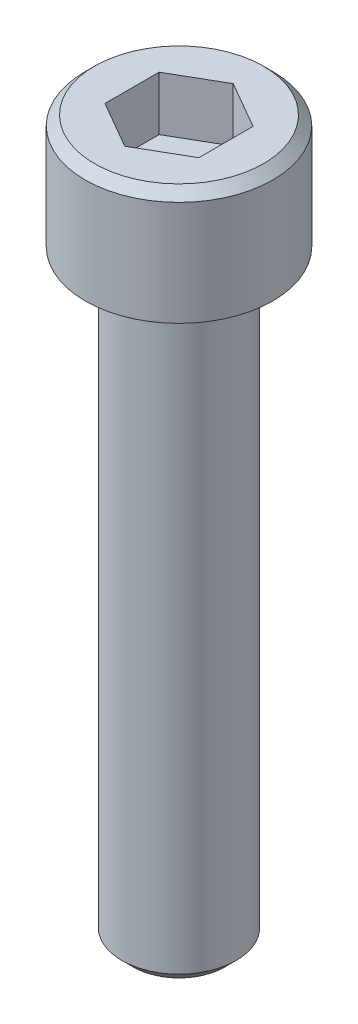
from build123d import *

# Parameters (mm, degrees)
CUT_EXTRUDE1_DEPTH = 2.286


with BuildPart() as part:
    # Sketch1 → Base-Revolve (revolve)
    with BuildSketch(Plane.XY, mode=Mode.PRIVATE) as base_revolve_sk:
        Polygon((0, 0), (3.96875, 0), (3.96875, 4.429125), (3.571875, 4.826), (0, 4.826), align=None)
    revolve(base_revolve_sk.sketch.rotate(Axis((0, 0, 0), (0, 1, 0)), 90), axis=Axis((0, 0, 0), (0, 1, 0)))

    # Sketch2 → Boss-Revolve1 (revolve)
    with BuildSketch(Plane.XY, mode=Mode.PRIVATE) as boss_revolve1_sk:
        Polygon((0, -25.4), (1.94056, -25.4), (2.413, -24.92756), (2.413, 0), (0, 0), align=None)
    revolve(boss_revolve1_sk.sketch.rotate(Axis((0, 0, 0), (0, 1, 0)), 90), axis=Axis((0, 0, 0), (0, 1, 0)))

    # Sketch3 → Cut-Extrude1 (cut)
    with BuildSketch(Plane(origin=(0, 4.826, 0), x_dir=(-1, 0, 0), z_dir=(0, 1, 0))):
        Polygon((1.98501, 1.146046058), (0, 2.292092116), (-1.98501, 1.146046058), (-1.98501, -1.146046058), (0, -2.292092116), (1.98501, -1.146046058), align=None)
    extrude(amount=-CUT_EXTRUDE1_DEPTH, mode=Mode.SUBTRACT)


solid = part.part
